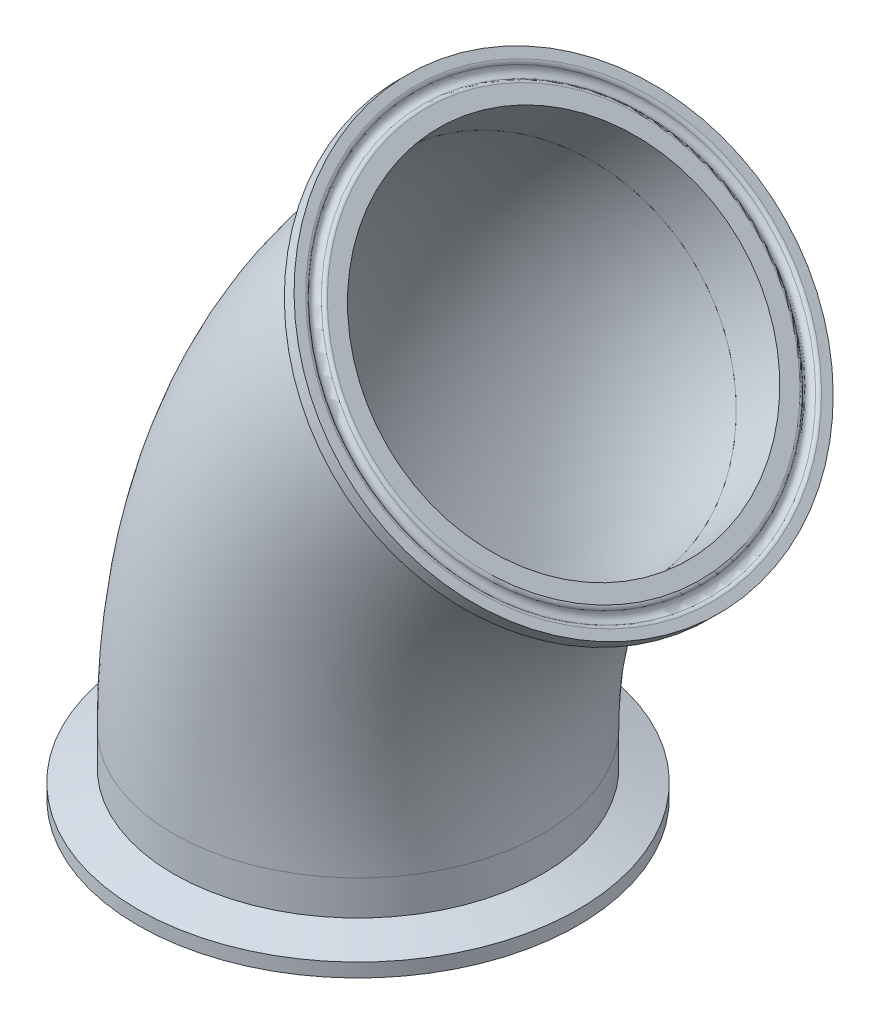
ISO-10303-21;
HEADER;
FILE_DESCRIPTION(('STEP AP214'),'2;1');
FILE_NAME('part.step','',(''),(''),'','','');
FILE_SCHEMA(('AUTOMOTIVE_DESIGN { 1 0 10303 214 1 1 1 1 }'));
ENDSEC;
DATA;
#1=APPLICATION_CONTEXT('core data for automotive mechanical design processes');
#2=APPLICATION_PROTOCOL_DEFINITION('international standard','automotive_design',2000,#1);
#3=PRODUCT_CONTEXT('',#1,'mechanical');
#4=PRODUCT('Part','Part','',(#3));
#5=PRODUCT_RELATED_PRODUCT_CATEGORY('part','',(#4));
#6=PRODUCT_DEFINITION_FORMATION('','',#4);
#7=PRODUCT_DEFINITION_CONTEXT('part definition',#1,'design');
#8=PRODUCT_DEFINITION('design','',#6,#7);
#9=PRODUCT_DEFINITION_SHAPE('','',#8);
#10=(LENGTH_UNIT() NAMED_UNIT(*) SI_UNIT(.MILLI.,.METRE.));
#11=(NAMED_UNIT(*) PLANE_ANGLE_UNIT() SI_UNIT($,.RADIAN.));
#12=(NAMED_UNIT(*) SI_UNIT($,.STERADIAN.) SOLID_ANGLE_UNIT());
#13=UNCERTAINTY_MEASURE_WITH_UNIT(LENGTH_MEASURE(1.E-05),#10,'distance_accuracy_value','');
#14=(GEOMETRIC_REPRESENTATION_CONTEXT(3) GLOBAL_UNCERTAINTY_ASSIGNED_CONTEXT((#13)) GLOBAL_UNIT_ASSIGNED_CONTEXT((#10,
#11,#12)) REPRESENTATION_CONTEXT('',''));
#15=CARTESIAN_POINT('',(0.,0.,0.));
#16=DIRECTION('',(0.,0.,1.));
#17=DIRECTION('',(1.,0.,0.));
#18=AXIS2_PLACEMENT_3D('',#15,#16,#17);
#19=CARTESIAN_POINT('',(124.842160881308,12.6866023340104,67.653362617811));
#20=DIRECTION('',(0.,0.,1.));
#21=DIRECTION('',(1.,0.,0.));
#22=AXIS2_PLACEMENT_3D('',#19,#20,#21);
#23=TOROIDAL_SURFACE('',#22,114.3,38.1);
#24=CARTESIAN_POINT('',(44.0198557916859,93.508907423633,67.6533626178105));
#25=DIRECTION('',(0.707106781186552,0.70710678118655,0.));
#26=DIRECTION('',(0.,0.,1.));
#27=AXIS2_PLACEMENT_3D('',#24,#25,#26);
#28=CIRCLE('',#27,38.1);
#29=CARTESIAN_POINT('',(17.0790874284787,120.44967578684,67.6533626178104));
#30=VERTEX_POINT('',#29);
#31=EDGE_CURVE('P0_E10',#30,#30,#28,.T.);
#32=CARTESIAN_POINT('',(10.5421608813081,12.6866023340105,67.653362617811));
#33=DIRECTION('',(0.,1.,0.));
#34=DIRECTION('',(0.,0.,1.));
#35=AXIS2_PLACEMENT_3D('',#32,#33,#34);
#36=CIRCLE('',#35,38.1);
#37=CARTESIAN_POINT('',(-27.5578391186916,12.6866023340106,67.653362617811));
#38=VERTEX_POINT('',#37);
#39=EDGE_CURVE('P0_E21',#38,#38,#36,.T.);
#40=CARTESIAN_POINT('',(124.842160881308,12.6866023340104,67.653362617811));
#41=DIRECTION('',(0.,0.,1.));
#42=DIRECTION('',(1.,0.,0.));
#43=AXIS2_PLACEMENT_3D('',#40,#41,#42);
#44=CIRCLE('',#43,152.4);
#45=EDGE_CURVE('',#30,#38,#44,.T.);
#46=ORIENTED_EDGE('',*,*,#31,.F.);
#47=ORIENTED_EDGE('',*,*,#39,.T.);
#48=ORIENTED_EDGE('',*,*,#45,.T.);
#49=ORIENTED_EDGE('',*,*,#45,.F.);
#50=EDGE_LOOP('',(#46,#48,#47,#49));
#51=FACE_BOUND('',#50,.T.);
#52=ADVANCED_FACE('P0_F15',(#51),#23,.T.);
#53=CARTESIAN_POINT('',(44.0198557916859,93.508907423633,67.6533626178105));
#54=DIRECTION('',(0.707106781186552,0.70710678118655,0.));
#55=DIRECTION('',(0.,0.,1.));
#56=AXIS2_PLACEMENT_3D('',#53,#54,#55);
#57=PLANE('',#56);
#58=CARTESIAN_POINT('',(44.0198557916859,93.508907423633,67.6533626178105));
#59=DIRECTION('',(0.707106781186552,0.70710678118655,0.));
#60=DIRECTION('',(-0.707106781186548,0.707106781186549,0.));
#61=AXIS2_PLACEMENT_3D('',#58,#59,#60);
#62=CIRCLE('',#61,36.449);
#63=CARTESIAN_POINT('',(18.2465207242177,119.282242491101,67.6533626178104));
#64=VERTEX_POINT('',#63);
#65=EDGE_CURVE('P0_E25',#64,#64,#62,.T.);
#66=ORIENTED_EDGE('',*,*,#65,.F.);
#67=EDGE_LOOP('',(#66));
#68=FACE_BOUND('',#67,.T.);
#69=ORIENTED_EDGE('',*,*,#31,.T.);
#70=EDGE_LOOP('',(#69));
#71=FACE_BOUND('',#70,.T.);
#72=ADVANCED_FACE('P0_F46',(#68,#71),#57,.T.);
#73=CARTESIAN_POINT('',(10.5421608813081,12.6866023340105,67.653362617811));
#74=DIRECTION('',(0.,1.,0.));
#75=DIRECTION('',(0.,0.,1.));
#76=AXIS2_PLACEMENT_3D('',#73,#74,#75);
#77=PLANE('',#76);
#78=CARTESIAN_POINT('',(10.5421608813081,12.6866023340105,67.653362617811));
#79=DIRECTION('',(0.,1.,0.));
#80=DIRECTION('',(0.,0.,1.));
#81=AXIS2_PLACEMENT_3D('',#78,#79,#80);
#82=CIRCLE('',#81,36.449);
#83=CARTESIAN_POINT('',(-25.9068391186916,12.6866023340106,67.653362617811));
#84=VERTEX_POINT('',#83);
#85=EDGE_CURVE('P0_E29',#84,#84,#82,.T.);
#86=ORIENTED_EDGE('',*,*,#85,.T.);
#87=EDGE_LOOP('',(#86));
#88=FACE_BOUND('',#87,.T.);
#89=ORIENTED_EDGE('',*,*,#39,.F.);
#90=EDGE_LOOP('',(#89));
#91=FACE_BOUND('',#90,.T.);
#92=ADVANCED_FACE('P0_F35',(#88,#91),#77,.F.);
#93=CARTESIAN_POINT('',(124.842160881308,12.6866023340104,67.653362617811));
#94=DIRECTION('',(0.,0.,1.));
#95=DIRECTION('',(1.,0.,0.));
#96=AXIS2_PLACEMENT_3D('',#93,#94,#95);
#97=TOROIDAL_SURFACE('',#96,114.3,36.449);
#98=CARTESIAN_POINT('',(124.842160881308,12.6866023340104,67.653362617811));
#99=DIRECTION('',(0.,0.,1.));
#100=DIRECTION('',(1.,0.,0.));
#101=AXIS2_PLACEMENT_3D('',#98,#99,#100);
#102=CIRCLE('',#101,150.749);
#103=EDGE_CURVE('',#64,#84,#102,.T.);
#104=ORIENTED_EDGE('',*,*,#65,.T.);
#105=ORIENTED_EDGE('',*,*,#85,.F.);
#106=ORIENTED_EDGE('',*,*,#103,.T.);
#107=ORIENTED_EDGE('',*,*,#103,.F.);
#108=EDGE_LOOP('',(#104,#106,#105,#107));
#109=FACE_BOUND('',#108,.T.);
#110=ADVANCED_FACE('P0_F38',(#109),#97,.F.);
#111=CLOSED_SHELL('',(#52,#72,#92,#110));
#112=MANIFOLD_SOLID_BREP('P0_B1',#111);
#113=CARTESIAN_POINT('',(52.4433360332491,101.932387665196,67.6533626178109));
#114=DIRECTION('',(0.707106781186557,0.707106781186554,0.));
#115=DIRECTION('',(0.573329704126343,-0.573329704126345,-0.585308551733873));
#116=AXIS2_PLACEMENT_3D('',#113,#114,#115);
#117=TOROIDAL_SURFACE('',#116,43.4867084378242,0.787400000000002);
#118=CARTESIAN_POINT('',(53.0001119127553,102.489163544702,67.653362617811));
#119=DIRECTION('',(0.707106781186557,0.707106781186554,0.));
#120=DIRECTION('',(0.573329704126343,-0.573329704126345,-0.585308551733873));
#121=AXIS2_PLACEMENT_3D('',#118,#119,#120);
#122=CIRCLE('',#121,43.4867084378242);
#123=CARTESIAN_POINT('',(77.9323335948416,77.5569418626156,42.2002202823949));
#124=VERTEX_POINT('',#123);
#125=EDGE_CURVE('P1_E48',#124,#124,#122,.T.);
#126=ORIENTED_EDGE('',*,*,#125,.T.);
#127=EDGE_LOOP('',(#126));
#128=FACE_BOUND('',#127,.T.);
#129=CARTESIAN_POINT('',(52.6646187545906,102.153670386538,67.6533626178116));
#130=DIRECTION('',(0.707106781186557,0.707106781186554,0.));
#131=DIRECTION('',(0.573329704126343,-0.573329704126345,-0.585308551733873));
#132=AXIS2_PLACEMENT_3D('',#129,#130,#131);
#133=CIRCLE('',#132,42.7641666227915);
#134=CARTESIAN_POINT('',(77.1825857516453,77.6357033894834,42.6231301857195));
#135=VERTEX_POINT('',#134);
#136=EDGE_CURVE('P1_E9',#135,#135,#133,.T.);
#137=ORIENTED_EDGE('',*,*,#136,.F.);
#138=EDGE_LOOP('',(#137));
#139=FACE_BOUND('',#138,.T.);
#140=ADVANCED_FACE('P1_F14',(#128,#139),#117,.T.);
#141=CARTESIAN_POINT('',(53.0001119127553,102.489163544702,67.653362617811));
#142=DIRECTION('',(0.707106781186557,0.707106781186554,0.));
#143=DIRECTION('',(0.573329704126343,-0.573329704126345,-0.585308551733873));
#144=AXIS2_PLACEMENT_3D('',#141,#142,#143);
#145=TOROIDAL_SURFACE('',#144,41.6687,1.1938);
#146=CARTESIAN_POINT('',(52.6646187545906,102.153670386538,67.6533626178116));
#147=DIRECTION('',(0.707106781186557,0.707106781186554,0.));
#148=DIRECTION('',(0.573329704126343,-0.573329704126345,-0.585308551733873));
#149=AXIS2_PLACEMENT_3D('',#146,#147,#148);
#150=CIRCLE('',#149,40.5732333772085);
#151=CARTESIAN_POINT('',(75.9264586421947,78.891830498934,43.9055021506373));
#152=VERTEX_POINT('',#151);
#153=EDGE_CURVE('P1_E20',#152,#152,#150,.T.);
#154=ORIENTED_EDGE('',*,*,#153,.F.);
#155=EDGE_LOOP('',(#154));
#156=FACE_BOUND('',#155,.T.);
#157=ORIENTED_EDGE('',*,*,#136,.T.);
#158=EDGE_LOOP('',(#157));
#159=FACE_BOUND('',#158,.T.);
#160=ADVANCED_FACE('P1_F97',(#156,#159),#145,.F.);
#161=CARTESIAN_POINT('',(52.4433360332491,101.932387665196,67.6533626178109));
#162=DIRECTION('',(0.707106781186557,0.707106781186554,0.));
#163=DIRECTION('',(0.573329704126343,-0.573329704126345,-0.585308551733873));
#164=AXIS2_PLACEMENT_3D('',#161,#162,#163);
#165=TOROIDAL_SURFACE('',#164,39.8506915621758,0.787399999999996);
#166=ORIENTED_EDGE('',*,*,#153,.T.);
#167=EDGE_LOOP('',(#166));
#168=FACE_BOUND('',#167,.T.);
#169=CARTESIAN_POINT('',(53.0001119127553,102.489163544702,67.653362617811));
#170=DIRECTION('',(0.707106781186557,0.707106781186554,0.));
#171=DIRECTION('',(0.573329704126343,-0.573329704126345,-0.585308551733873));
#172=AXIS2_PLACEMENT_3D('',#169,#170,#171);
#173=CIRCLE('',#172,39.8506915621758);
#174=CARTESIAN_POINT('',(75.8476971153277,79.6415783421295,44.3284120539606));
#175=VERTEX_POINT('',#174);
#176=EDGE_CURVE('P1_E24',#175,#175,#173,.T.);
#177=ORIENTED_EDGE('',*,*,#176,.F.);
#178=EDGE_LOOP('',(#177));
#179=FACE_BOUND('',#178,.T.);
#180=ADVANCED_FACE('P1_F93',(#168,#179),#165,.T.);
#181=CARTESIAN_POINT('',(53.0001119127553,102.489163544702,67.653362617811));
#182=DIRECTION('',(-0.707106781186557,-0.707106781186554,0.));
#183=DIRECTION('',(-0.573329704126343,0.573329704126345,0.585308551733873));
#184=AXIS2_PLACEMENT_3D('',#181,#182,#183);
#185=PLANE('',#184);
#186=CARTESIAN_POINT('',(53.0001119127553,102.489163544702,67.653362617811));
#187=DIRECTION('',(0.707106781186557,0.707106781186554,0.));
#188=DIRECTION('',(0.573329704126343,-0.573329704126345,-0.585308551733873));
#189=AXIS2_PLACEMENT_3D('',#186,#187,#188);
#190=CIRCLE('',#189,36.449);
#191=CARTESIAN_POINT('',(73.8974062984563,81.5918691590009,46.3194512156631));
#192=VERTEX_POINT('',#191);
#193=EDGE_CURVE('P1_E28',#192,#192,#190,.T.);
#194=ORIENTED_EDGE('',*,*,#193,.F.);
#195=EDGE_LOOP('',(#194));
#196=FACE_BOUND('',#195,.T.);
#197=ORIENTED_EDGE('',*,*,#176,.T.);
#198=EDGE_LOOP('',(#197));
#199=FACE_BOUND('',#198,.T.);
#200=ADVANCED_FACE('P1_F86',(#196,#199),#185,.F.);
#201=CARTESIAN_POINT('',(53.0001119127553,102.489163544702,67.653362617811));
#202=DIRECTION('',(0.707106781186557,0.707106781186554,0.));
#203=DIRECTION('',(0.573329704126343,-0.573329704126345,-0.585308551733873));
#204=AXIS2_PLACEMENT_3D('',#201,#202,#203);
#205=CYLINDRICAL_SURFACE('',#204,36.449);
#206=ORIENTED_EDGE('',*,*,#193,.T.);
#207=EDGE_LOOP('',(#206));
#208=FACE_BOUND('',#207,.T.);
#209=CARTESIAN_POINT('',(44.0198557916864,93.5089074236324,67.6533626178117));
#210=DIRECTION('',(0.707106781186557,0.707106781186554,0.));
#211=DIRECTION('',(0.573329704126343,-0.573329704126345,-0.585308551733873));
#212=AXIS2_PLACEMENT_3D('',#209,#210,#211);
#213=CIRCLE('',#212,36.449);
#214=CARTESIAN_POINT('',(64.9171501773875,72.6116130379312,46.3194512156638));
#215=VERTEX_POINT('',#214);
#216=EDGE_CURVE('P1_E33',#215,#215,#213,.T.);
#217=ORIENTED_EDGE('',*,*,#216,.F.);
#218=EDGE_LOOP('',(#217));
#219=FACE_BOUND('',#218,.T.);
#220=ADVANCED_FACE('P1_F81',(#208,#219),#205,.F.);
#221=CARTESIAN_POINT('',(44.0198557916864,93.5089074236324,67.6533626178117));
#222=DIRECTION('',(0.707106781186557,0.707106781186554,0.));
#223=DIRECTION('',(0.573329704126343,-0.573329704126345,-0.585308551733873));
#224=AXIS2_PLACEMENT_3D('',#221,#222,#223);
#225=PLANE('',#224);
#226=CARTESIAN_POINT('',(44.0198557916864,93.5089074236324,67.6533626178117));
#227=DIRECTION('',(0.707106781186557,0.707106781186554,0.));
#228=DIRECTION('',(0.573329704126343,-0.573329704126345,-0.585308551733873));
#229=AXIS2_PLACEMENT_3D('',#226,#227,#228);
#230=CIRCLE('',#229,38.1);
#231=CARTESIAN_POINT('',(65.8637175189,71.6650456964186,45.3531067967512));
#232=VERTEX_POINT('',#231);
#233=EDGE_CURVE('P1_E36',#232,#232,#230,.T.);
#234=ORIENTED_EDGE('',*,*,#233,.F.);
#235=EDGE_LOOP('',(#234));
#236=FACE_BOUND('',#235,.T.);
#237=ORIENTED_EDGE('',*,*,#216,.T.);
#238=EDGE_LOOP('',(#237));
#239=FACE_BOUND('',#238,.T.);
#240=ADVANCED_FACE('P1_F75',(#236,#239),#225,.F.);
#241=CARTESIAN_POINT('',(53.0001119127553,102.489163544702,67.653362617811));
#242=DIRECTION('',(0.707106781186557,0.707106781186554,0.));
#243=DIRECTION('',(0.573329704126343,-0.573329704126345,-0.585308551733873));
#244=AXIS2_PLACEMENT_3D('',#241,#242,#243);
#245=CYLINDRICAL_SURFACE('',#244,38.1);
#246=CARTESIAN_POINT('',(49.0960464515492,98.5850980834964,67.6533626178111));
#247=DIRECTION('',(0.707106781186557,0.707106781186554,0.));
#248=DIRECTION('',(0.573329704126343,-0.573329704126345,-0.585308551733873));
#249=AXIS2_PLACEMENT_3D('',#246,#247,#248);
#250=CIRCLE('',#249,38.1);
#251=CARTESIAN_POINT('',(70.9399081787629,76.7412363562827,45.3531067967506));
#252=VERTEX_POINT('',#251);
#253=EDGE_CURVE('P1_E39',#252,#252,#250,.T.);
#254=ORIENTED_EDGE('',*,*,#253,.F.);
#255=EDGE_LOOP('',(#254));
#256=FACE_BOUND('',#255,.T.);
#257=ORIENTED_EDGE('',*,*,#233,.T.);
#258=EDGE_LOOP('',(#257));
#259=FACE_BOUND('',#258,.T.);
#260=ADVANCED_FACE('P1_F69',(#256,#259),#245,.T.);
#261=CARTESIAN_POINT('',(49.0960464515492,98.5850980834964,67.6533626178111));
#262=DIRECTION('',(0.707106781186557,0.707106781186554,0.));
#263=DIRECTION('',(0.573329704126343,-0.573329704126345,-0.585308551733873));
#264=AXIS2_PLACEMENT_3D('',#261,#262,#263);
#265=CONICAL_SURFACE('',#264,38.1,1.22173047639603);
#266=CARTESIAN_POINT('',(50.988534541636,100.477586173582,67.6533626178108));
#267=DIRECTION('',(0.707106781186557,0.707106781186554,0.));
#268=DIRECTION('',(0.573329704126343,-0.573329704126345,-0.585308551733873));
#269=AXIS2_PLACEMENT_3D('',#266,#267,#268);
#270=CIRCLE('',#269,45.4533);
#271=CARTESIAN_POINT('',(77.0482615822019,74.4178591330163,41.0491574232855));
#272=VERTEX_POINT('',#271);
#273=EDGE_CURVE('P1_E42',#272,#272,#270,.T.);
#274=ORIENTED_EDGE('',*,*,#273,.F.);
#275=EDGE_LOOP('',(#274));
#276=FACE_BOUND('',#275,.T.);
#277=ORIENTED_EDGE('',*,*,#253,.T.);
#278=EDGE_LOOP('',(#277));
#279=FACE_BOUND('',#278,.T.);
#280=ADVANCED_FACE('P1_F63',(#276,#279),#265,.T.);
#281=CARTESIAN_POINT('',(53.0001119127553,102.489163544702,67.653362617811));
#282=DIRECTION('',(0.707106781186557,0.707106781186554,0.));
#283=DIRECTION('',(0.573329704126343,-0.573329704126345,-0.585308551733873));
#284=AXIS2_PLACEMENT_3D('',#281,#282,#283);
#285=CYLINDRICAL_SURFACE('',#284,45.4533);
#286=CARTESIAN_POINT('',(53.0001119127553,102.489163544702,67.653362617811));
#287=DIRECTION('',(0.707106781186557,0.707106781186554,0.));
#288=DIRECTION('',(0.573329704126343,-0.573329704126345,-0.585308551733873));
#289=AXIS2_PLACEMENT_3D('',#286,#287,#288);
#290=CIRCLE('',#289,45.4533);
#291=CARTESIAN_POINT('',(79.0598389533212,76.429436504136,41.0491574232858));
#292=VERTEX_POINT('',#291);
#293=EDGE_CURVE('P1_E45',#292,#292,#290,.T.);
#294=ORIENTED_EDGE('',*,*,#293,.F.);
#295=EDGE_LOOP('',(#294));
#296=FACE_BOUND('',#295,.T.);
#297=ORIENTED_EDGE('',*,*,#273,.T.);
#298=EDGE_LOOP('',(#297));
#299=FACE_BOUND('',#298,.T.);
#300=ADVANCED_FACE('P1_F57',(#296,#299),#285,.T.);
#301=CARTESIAN_POINT('',(53.0001119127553,102.489163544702,67.653362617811));
#302=DIRECTION('',(-0.707106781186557,-0.707106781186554,0.));
#303=DIRECTION('',(-0.573329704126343,0.573329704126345,0.585308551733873));
#304=AXIS2_PLACEMENT_3D('',#301,#302,#303);
#305=PLANE('',#304);
#306=ORIENTED_EDGE('',*,*,#125,.F.);
#307=EDGE_LOOP('',(#306));
#308=FACE_BOUND('',#307,.T.);
#309=ORIENTED_EDGE('',*,*,#293,.T.);
#310=EDGE_LOOP('',(#309));
#311=FACE_BOUND('',#310,.T.);
#312=ADVANCED_FACE('P1_F54',(#308,#311),#305,.F.);
#313=CLOSED_SHELL('',(#140,#160,#180,#200,#220,#240,#260,#280,#300,#312));
#314=MANIFOLD_SOLID_BREP('P1_B1',#313);
#315=CARTESIAN_POINT('',(10.5421608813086,0.774002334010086,67.653362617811));
#316=DIRECTION('',(0.,-1.00000000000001,0.));
#317=DIRECTION('',(0.,0.,-1.));
#318=AXIS2_PLACEMENT_3D('',#315,#316,#317);
#319=TOROIDAL_SURFACE('',#318,43.4867084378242,0.787400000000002);
#320=CARTESIAN_POINT('',(10.5421608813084,-0.0133976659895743,67.653362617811));
#321=DIRECTION('',(0.,-1.00000000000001,0.));
#322=DIRECTION('',(0.,0.,-1.));
#323=AXIS2_PLACEMENT_3D('',#320,#321,#322);
#324=CIRCLE('',#323,43.4867084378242);
#325=CARTESIAN_POINT('',(10.5421608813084,-0.0133976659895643,24.1666541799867));
#326=VERTEX_POINT('',#325);
#327=EDGE_CURVE('P2_E49',#326,#326,#324,.T.);
#328=ORIENTED_EDGE('',*,*,#327,.T.);
#329=EDGE_LOOP('',(#328));
#330=FACE_BOUND('',#329,.T.);
#331=CARTESIAN_POINT('',(10.5421608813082,0.461061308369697,67.6533626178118));
#332=DIRECTION('',(0.,-1.00000000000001,0.));
#333=DIRECTION('',(0.,0.,-1.));
#334=AXIS2_PLACEMENT_3D('',#331,#332,#333);
#335=CIRCLE('',#334,42.7641666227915);
#336=CARTESIAN_POINT('',(10.5421608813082,0.461061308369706,24.8891959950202));
#337=VERTEX_POINT('',#336);
#338=EDGE_CURVE('P2_E10',#337,#337,#335,.T.);
#339=ORIENTED_EDGE('',*,*,#338,.F.);
#340=EDGE_LOOP('',(#339));
#341=FACE_BOUND('',#340,.T.);
#342=ADVANCED_FACE('P2_F15',(#330,#341),#319,.T.);
#343=CARTESIAN_POINT('',(10.5421608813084,-0.0133976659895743,67.653362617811));
#344=DIRECTION('',(0.,-1.00000000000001,0.));
#345=DIRECTION('',(0.,0.,-1.));
#346=AXIS2_PLACEMENT_3D('',#343,#344,#345);
#347=TOROIDAL_SURFACE('',#346,41.6687,1.1938);
#348=CARTESIAN_POINT('',(10.5421608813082,0.461061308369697,67.6533626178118));
#349=DIRECTION('',(0.,-1.00000000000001,0.));
#350=DIRECTION('',(0.,0.,-1.));
#351=AXIS2_PLACEMENT_3D('',#348,#349,#350);
#352=CIRCLE('',#351,40.5732333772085);
#353=CARTESIAN_POINT('',(10.5421608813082,0.461061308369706,27.0801292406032));
#354=VERTEX_POINT('',#353);
#355=EDGE_CURVE('P2_E21',#354,#354,#352,.T.);
#356=ORIENTED_EDGE('',*,*,#355,.F.);
#357=EDGE_LOOP('',(#356));
#358=FACE_BOUND('',#357,.T.);
#359=ORIENTED_EDGE('',*,*,#338,.T.);
#360=EDGE_LOOP('',(#359));
#361=FACE_BOUND('',#360,.T.);
#362=ADVANCED_FACE('P2_F98',(#358,#361),#347,.F.);
#363=CARTESIAN_POINT('',(10.5421608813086,0.774002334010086,67.653362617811));
#364=DIRECTION('',(0.,-1.00000000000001,0.));
#365=DIRECTION('',(0.,0.,-1.));
#366=AXIS2_PLACEMENT_3D('',#363,#364,#365);
#367=TOROIDAL_SURFACE('',#366,39.8506915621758,0.787399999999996);
#368=ORIENTED_EDGE('',*,*,#355,.T.);
#369=EDGE_LOOP('',(#368));
#370=FACE_BOUND('',#369,.T.);
#371=CARTESIAN_POINT('',(10.5421608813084,-0.0133976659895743,67.653362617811));
#372=DIRECTION('',(0.,-1.00000000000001,0.));
#373=DIRECTION('',(0.,0.,-1.));
#374=AXIS2_PLACEMENT_3D('',#371,#372,#373);
#375=CIRCLE('',#374,39.8506915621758);
#376=CARTESIAN_POINT('',(10.5421608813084,-0.0133976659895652,27.8026710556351));
#377=VERTEX_POINT('',#376);
#378=EDGE_CURVE('P2_E25',#377,#377,#375,.T.);
#379=ORIENTED_EDGE('',*,*,#378,.F.);
#380=EDGE_LOOP('',(#379));
#381=FACE_BOUND('',#380,.T.);
#382=ADVANCED_FACE('P2_F94',(#370,#381),#367,.T.);
#383=CARTESIAN_POINT('',(10.5421608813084,-0.0133976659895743,67.653362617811));
#384=DIRECTION('',(0.,1.00000000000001,0.));
#385=DIRECTION('',(0.,0.,1.));
#386=AXIS2_PLACEMENT_3D('',#383,#384,#385);
#387=PLANE('',#386);
#388=CARTESIAN_POINT('',(10.5421608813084,-0.0133976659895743,67.653362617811));
#389=DIRECTION('',(0.,-1.00000000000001,0.));
#390=DIRECTION('',(0.,0.,-1.));
#391=AXIS2_PLACEMENT_3D('',#388,#389,#390);
#392=CIRCLE('',#391,36.449);
#393=CARTESIAN_POINT('',(10.5421608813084,-0.013397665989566,31.2043626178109));
#394=VERTEX_POINT('',#393);
#395=EDGE_CURVE('P2_E29',#394,#394,#392,.T.);
#396=ORIENTED_EDGE('',*,*,#395,.F.);
#397=EDGE_LOOP('',(#396));
#398=FACE_BOUND('',#397,.T.);
#399=ORIENTED_EDGE('',*,*,#378,.T.);
#400=EDGE_LOOP('',(#399));
#401=FACE_BOUND('',#400,.T.);
#402=ADVANCED_FACE('P2_F87',(#398,#401),#387,.F.);
#403=CARTESIAN_POINT('',(10.5421608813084,-0.0133976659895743,67.653362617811));
#404=DIRECTION('',(0.,-1.00000000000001,0.));
#405=DIRECTION('',(0.,0.,-1.));
#406=AXIS2_PLACEMENT_3D('',#403,#404,#405);
#407=CYLINDRICAL_SURFACE('',#406,36.449);
#408=ORIENTED_EDGE('',*,*,#395,.T.);
#409=EDGE_LOOP('',(#408));
#410=FACE_BOUND('',#409,.T.);
#411=CARTESIAN_POINT('',(10.5421608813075,12.6866023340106,67.653362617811));
#412=DIRECTION('',(0.,-1.00000000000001,0.));
#413=DIRECTION('',(0.,0.,-1.));
#414=AXIS2_PLACEMENT_3D('',#411,#412,#413);
#415=CIRCLE('',#414,36.449);
#416=CARTESIAN_POINT('',(10.5421608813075,12.6866023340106,31.2043626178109));
#417=VERTEX_POINT('',#416);
#418=EDGE_CURVE('P2_E34',#417,#417,#415,.T.);
#419=ORIENTED_EDGE('',*,*,#418,.F.);
#420=EDGE_LOOP('',(#419));
#421=FACE_BOUND('',#420,.T.);
#422=ADVANCED_FACE('P2_F82',(#410,#421),#407,.F.);
#423=CARTESIAN_POINT('',(10.5421608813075,12.6866023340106,67.653362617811));
#424=DIRECTION('',(0.,-1.00000000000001,0.));
#425=DIRECTION('',(0.,0.,-1.));
#426=AXIS2_PLACEMENT_3D('',#423,#424,#425);
#427=PLANE('',#426);
#428=CARTESIAN_POINT('',(10.5421608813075,12.6866023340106,67.653362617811));
#429=DIRECTION('',(0.,-1.00000000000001,0.));
#430=DIRECTION('',(0.,0.,-1.));
#431=AXIS2_PLACEMENT_3D('',#428,#429,#430);
#432=CIRCLE('',#431,38.1);
#433=CARTESIAN_POINT('',(10.5421608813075,12.6866023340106,29.5533626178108));
#434=VERTEX_POINT('',#433);
#435=EDGE_CURVE('P2_E37',#434,#434,#432,.T.);
#436=ORIENTED_EDGE('',*,*,#435,.F.);
#437=EDGE_LOOP('',(#436));
#438=FACE_BOUND('',#437,.T.);
#439=ORIENTED_EDGE('',*,*,#418,.T.);
#440=EDGE_LOOP('',(#439));
#441=FACE_BOUND('',#440,.T.);
#442=ADVANCED_FACE('P2_F76',(#438,#441),#427,.F.);
#443=CARTESIAN_POINT('',(10.5421608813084,-0.0133976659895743,67.653362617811));
#444=DIRECTION('',(0.,-1.00000000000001,0.));
#445=DIRECTION('',(0.,0.,-1.));
#446=AXIS2_PLACEMENT_3D('',#443,#444,#445);
#447=CYLINDRICAL_SURFACE('',#446,38.1);
#448=CARTESIAN_POINT('',(10.5421608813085,5.50778465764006,67.6533626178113));
#449=DIRECTION('',(0.,-1.00000000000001,0.));
#450=DIRECTION('',(0.,0.,-1.));
#451=AXIS2_PLACEMENT_3D('',#448,#449,#450);
#452=CIRCLE('',#451,38.1);
#453=CARTESIAN_POINT('',(10.5421608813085,5.50778465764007,29.5533626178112));
#454=VERTEX_POINT('',#453);
#455=EDGE_CURVE('P2_E40',#454,#454,#452,.T.);
#456=ORIENTED_EDGE('',*,*,#455,.F.);
#457=EDGE_LOOP('',(#456));
#458=FACE_BOUND('',#457,.T.);
#459=ORIENTED_EDGE('',*,*,#435,.T.);
#460=EDGE_LOOP('',(#459));
#461=FACE_BOUND('',#460,.T.);
#462=ADVANCED_FACE('P2_F70',(#458,#461),#447,.T.);
#463=CARTESIAN_POINT('',(10.5421608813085,5.50778465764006,67.6533626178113));
#464=DIRECTION('',(0.,-1.00000000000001,0.));
#465=DIRECTION('',(0.,0.,-1.));
#466=AXIS2_PLACEMENT_3D('',#463,#464,#465);
#467=CONICAL_SURFACE('',#466,38.1,1.22173047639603);
#468=CARTESIAN_POINT('',(10.5421608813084,2.83140233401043,67.6533626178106));
#469=DIRECTION('',(0.,-1.00000000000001,0.));
#470=DIRECTION('',(0.,0.,-1.));
#471=AXIS2_PLACEMENT_3D('',#468,#469,#470);
#472=CIRCLE('',#471,45.4533);
#473=CARTESIAN_POINT('',(10.5421608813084,2.83140233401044,22.2000626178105));
#474=VERTEX_POINT('',#473);
#475=EDGE_CURVE('P2_E43',#474,#474,#472,.T.);
#476=ORIENTED_EDGE('',*,*,#475,.F.);
#477=EDGE_LOOP('',(#476));
#478=FACE_BOUND('',#477,.T.);
#479=ORIENTED_EDGE('',*,*,#455,.T.);
#480=EDGE_LOOP('',(#479));
#481=FACE_BOUND('',#480,.T.);
#482=ADVANCED_FACE('P2_F64',(#478,#481),#467,.T.);
#483=CARTESIAN_POINT('',(10.5421608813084,-0.0133976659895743,67.653362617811));
#484=DIRECTION('',(0.,-1.00000000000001,0.));
#485=DIRECTION('',(0.,0.,-1.));
#486=AXIS2_PLACEMENT_3D('',#483,#484,#485);
#487=CYLINDRICAL_SURFACE('',#486,45.4533);
#488=CARTESIAN_POINT('',(10.5421608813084,-0.0133976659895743,67.653362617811));
#489=DIRECTION('',(0.,-1.00000000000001,0.));
#490=DIRECTION('',(0.,0.,-1.));
#491=AXIS2_PLACEMENT_3D('',#488,#489,#490);
#492=CIRCLE('',#491,45.4533);
#493=CARTESIAN_POINT('',(10.5421608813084,-0.0133976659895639,22.2000626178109));
#494=VERTEX_POINT('',#493);
#495=EDGE_CURVE('P2_E46',#494,#494,#492,.T.);
#496=ORIENTED_EDGE('',*,*,#495,.F.);
#497=EDGE_LOOP('',(#496));
#498=FACE_BOUND('',#497,.T.);
#499=ORIENTED_EDGE('',*,*,#475,.T.);
#500=EDGE_LOOP('',(#499));
#501=FACE_BOUND('',#500,.T.);
#502=ADVANCED_FACE('P2_F58',(#498,#501),#487,.T.);
#503=CARTESIAN_POINT('',(10.5421608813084,-0.0133976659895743,67.653362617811));
#504=DIRECTION('',(0.,1.00000000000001,0.));
#505=DIRECTION('',(0.,0.,1.));
#506=AXIS2_PLACEMENT_3D('',#503,#504,#505);
#507=PLANE('',#506);
#508=ORIENTED_EDGE('',*,*,#327,.F.);
#509=EDGE_LOOP('',(#508));
#510=FACE_BOUND('',#509,.T.);
#511=ORIENTED_EDGE('',*,*,#495,.T.);
#512=EDGE_LOOP('',(#511));
#513=FACE_BOUND('',#512,.T.);
#514=ADVANCED_FACE('P2_F55',(#510,#513),#507,.F.);
#515=CLOSED_SHELL('',(#342,#362,#382,#402,#422,#442,#462,#482,#502,#514));
#516=MANIFOLD_SOLID_BREP('P2_B1',#515);
#517=ADVANCED_BREP_SHAPE_REPRESENTATION('',(#18,#112,#314,#516),#14);
#518=SHAPE_DEFINITION_REPRESENTATION(#9,#517);
ENDSEC;
END-ISO-10303-21;
